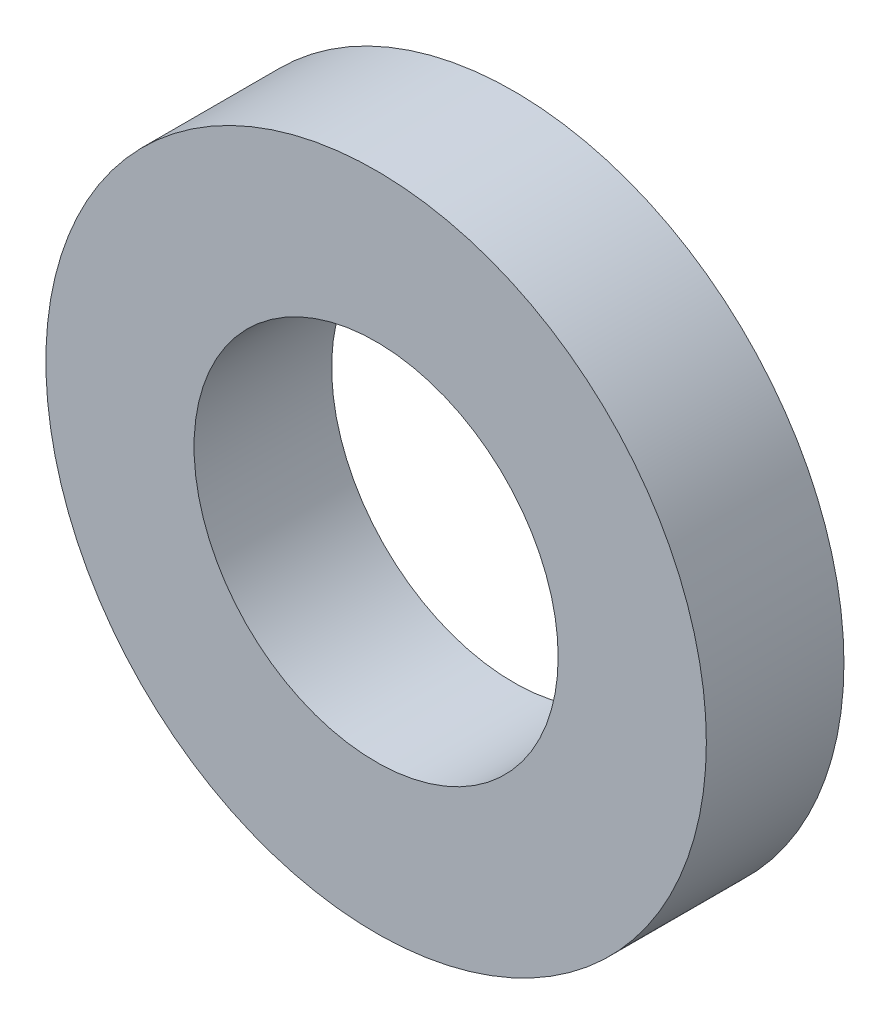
ISO-10303-21;
HEADER;
FILE_DESCRIPTION(('STEP AP214'),'2;1');
FILE_NAME('part.step','',(''),(''),'','','');
FILE_SCHEMA(('AUTOMOTIVE_DESIGN { 1 0 10303 214 1 1 1 1 }'));
ENDSEC;
DATA;
#1=APPLICATION_CONTEXT('core data for automotive mechanical design processes');
#2=APPLICATION_PROTOCOL_DEFINITION('international standard','automotive_design',2000,#1);
#3=PRODUCT_CONTEXT('',#1,'mechanical');
#4=PRODUCT('Part','Part','',(#3));
#5=PRODUCT_RELATED_PRODUCT_CATEGORY('part','',(#4));
#6=PRODUCT_DEFINITION_FORMATION('','',#4);
#7=PRODUCT_DEFINITION_CONTEXT('part definition',#1,'design');
#8=PRODUCT_DEFINITION('design','',#6,#7);
#9=PRODUCT_DEFINITION_SHAPE('','',#8);
#10=(LENGTH_UNIT() NAMED_UNIT(*) SI_UNIT(.MILLI.,.METRE.));
#11=(NAMED_UNIT(*) PLANE_ANGLE_UNIT() SI_UNIT($,.RADIAN.));
#12=(NAMED_UNIT(*) SI_UNIT($,.STERADIAN.) SOLID_ANGLE_UNIT());
#13=UNCERTAINTY_MEASURE_WITH_UNIT(LENGTH_MEASURE(1.E-05),#10,'distance_accuracy_value','');
#14=(GEOMETRIC_REPRESENTATION_CONTEXT(3) GLOBAL_UNCERTAINTY_ASSIGNED_CONTEXT((#13)) GLOBAL_UNIT_ASSIGNED_CONTEXT((#10,
#11,#12)) REPRESENTATION_CONTEXT('',''));
#15=CARTESIAN_POINT('',(0.,0.,0.));
#16=DIRECTION('',(0.,0.,1.));
#17=DIRECTION('',(1.,0.,0.));
#18=AXIS2_PLACEMENT_3D('',#15,#16,#17);
#19=CARTESIAN_POINT('',(0.,0.,-1.651));
#20=DIRECTION('',(0.,0.,1.));
#21=DIRECTION('',(1.,0.,0.));
#22=AXIS2_PLACEMENT_3D('',#19,#20,#21);
#23=CYLINDRICAL_SURFACE('',#22,3.9624);
#24=CARTESIAN_POINT('',(0.,0.,-1.651));
#25=DIRECTION('',(0.,0.,1.));
#26=DIRECTION('',(1.,0.,0.));
#27=AXIS2_PLACEMENT_3D('',#24,#25,#26);
#28=CIRCLE('',#27,3.9624);
#29=CARTESIAN_POINT('',(3.9624,0.,-1.651));
#30=VERTEX_POINT('',#29);
#31=EDGE_CURVE('E10',#30,#30,#28,.T.);
#32=CARTESIAN_POINT('',(0.,0.,0.));
#33=DIRECTION('',(0.,0.,1.));
#34=DIRECTION('',(1.,0.,0.));
#35=AXIS2_PLACEMENT_3D('',#32,#33,#34);
#36=CIRCLE('',#35,3.9624);
#37=CARTESIAN_POINT('',(3.9624,0.,0.));
#38=VERTEX_POINT('',#37);
#39=EDGE_CURVE('E39',#38,#38,#36,.T.);
#40=CARTESIAN_POINT('',(3.9624,0.,-1.651));
#41=CARTESIAN_POINT('',(3.9624,0.,-1.63380208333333));
#42=CARTESIAN_POINT('',(3.9624,0.,-1.61660416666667));
#43=CARTESIAN_POINT('',(3.9624,0.,-1.58220833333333));
#44=CARTESIAN_POINT('',(3.9624,0.,-1.56501041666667));
#45=CARTESIAN_POINT('',(3.9624,0.,-1.53061458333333));
#46=CARTESIAN_POINT('',(3.9624,0.,-1.51341666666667));
#47=CARTESIAN_POINT('',(3.9624,0.,-1.47902083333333));
#48=CARTESIAN_POINT('',(3.9624,0.,-1.46182291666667));
#49=CARTESIAN_POINT('',(3.9624,0.,-1.42742708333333));
#50=CARTESIAN_POINT('',(3.9624,0.,-1.41022916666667));
#51=CARTESIAN_POINT('',(3.9624,0.,-1.37583333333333));
#52=CARTESIAN_POINT('',(3.9624,0.,-1.35863541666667));
#53=CARTESIAN_POINT('',(3.9624,0.,-1.32423958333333));
#54=CARTESIAN_POINT('',(3.9624,0.,-1.30704166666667));
#55=CARTESIAN_POINT('',(3.9624,0.,-1.27264583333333));
#56=CARTESIAN_POINT('',(3.9624,0.,-1.25544791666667));
#57=CARTESIAN_POINT('',(3.9624,0.,-1.22105208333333));
#58=CARTESIAN_POINT('',(3.9624,0.,-1.20385416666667));
#59=CARTESIAN_POINT('',(3.9624,0.,-1.16945833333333));
#60=CARTESIAN_POINT('',(3.9624,0.,-1.15226041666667));
#61=CARTESIAN_POINT('',(3.9624,0.,-1.11786458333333));
#62=CARTESIAN_POINT('',(3.9624,0.,-1.10066666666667));
#63=CARTESIAN_POINT('',(3.9624,0.,-1.06627083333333));
#64=CARTESIAN_POINT('',(3.9624,0.,-1.04907291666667));
#65=CARTESIAN_POINT('',(3.9624,0.,-1.01467708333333));
#66=CARTESIAN_POINT('',(3.9624,0.,-0.997479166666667));
#67=CARTESIAN_POINT('',(3.9624,0.,-0.963083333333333));
#68=CARTESIAN_POINT('',(3.9624,0.,-0.945885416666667));
#69=CARTESIAN_POINT('',(3.9624,0.,-0.911489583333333));
#70=CARTESIAN_POINT('',(3.9624,0.,-0.894291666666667));
#71=CARTESIAN_POINT('',(3.9624,0.,-0.859895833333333));
#72=CARTESIAN_POINT('',(3.9624,0.,-0.842697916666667));
#73=CARTESIAN_POINT('',(3.9624,0.,-0.808302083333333));
#74=CARTESIAN_POINT('',(3.9624,0.,-0.791104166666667));
#75=CARTESIAN_POINT('',(3.9624,0.,-0.756708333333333));
#76=CARTESIAN_POINT('',(3.9624,0.,-0.739510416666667));
#77=CARTESIAN_POINT('',(3.9624,0.,-0.705114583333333));
#78=CARTESIAN_POINT('',(3.9624,0.,-0.687916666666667));
#79=CARTESIAN_POINT('',(3.9624,0.,-0.653520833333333));
#80=CARTESIAN_POINT('',(3.9624,0.,-0.636322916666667));
#81=CARTESIAN_POINT('',(3.9624,0.,-0.601927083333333));
#82=CARTESIAN_POINT('',(3.9624,0.,-0.584729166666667));
#83=CARTESIAN_POINT('',(3.9624,0.,-0.550333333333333));
#84=CARTESIAN_POINT('',(3.9624,0.,-0.533135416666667));
#85=CARTESIAN_POINT('',(3.9624,0.,-0.498739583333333));
#86=CARTESIAN_POINT('',(3.9624,0.,-0.481541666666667));
#87=CARTESIAN_POINT('',(3.9624,0.,-0.447145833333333));
#88=CARTESIAN_POINT('',(3.9624,0.,-0.429947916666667));
#89=CARTESIAN_POINT('',(3.9624,0.,-0.395552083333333));
#90=CARTESIAN_POINT('',(3.9624,0.,-0.378354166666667));
#91=CARTESIAN_POINT('',(3.9624,0.,-0.343958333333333));
#92=CARTESIAN_POINT('',(3.9624,0.,-0.326760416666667));
#93=CARTESIAN_POINT('',(3.9624,0.,-0.292364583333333));
#94=CARTESIAN_POINT('',(3.9624,0.,-0.275166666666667));
#95=CARTESIAN_POINT('',(3.9624,0.,-0.240770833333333));
#96=CARTESIAN_POINT('',(3.9624,0.,-0.223572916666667));
#97=CARTESIAN_POINT('',(3.9624,0.,-0.189177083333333));
#98=CARTESIAN_POINT('',(3.9624,0.,-0.171979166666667));
#99=CARTESIAN_POINT('',(3.9624,0.,-0.137583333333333));
#100=CARTESIAN_POINT('',(3.9624,0.,-0.120385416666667));
#101=CARTESIAN_POINT('',(3.9624,0.,-0.0859895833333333));
#102=CARTESIAN_POINT('',(3.9624,0.,-0.0687916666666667));
#103=CARTESIAN_POINT('',(3.9624,0.,-0.0343958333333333));
#104=CARTESIAN_POINT('',(3.9624,0.,-0.0171979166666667));
#105=CARTESIAN_POINT('',(3.9624,0.,0.));
#106=B_SPLINE_CURVE_WITH_KNOTS('',3,(#40,#41,#42,#43,#44,#45,#46,#47,#48,#49,#50,#51,#52,#53,
#54,#55,#56,#57,#58,#59,#60,#61,#62,#63,#64,#65,#66,#67,#68,#69,#70,#71,#72,#73,#74,#75,#76,#77,
#78,#79,#80,#81,#82,#83,#84,#85,#86,#87,#88,#89,#90,#91,#92,#93,#94,#95,#96,#97,#98,#99,#100,
#101,#102,#103,#104,#105),.UNSPECIFIED.,.F.,.F.,(4,2,2,2,2,2,2,2,2,2,2,2,2,2,2,2,2,2,2,2,2,2,2,
2,2,2,2,2,2,2,2,2,4),(0.,0.0515937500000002,0.1031875,0.15478125,0.206375,0.25796875,0.3095625,
0.36115625,0.41275,0.46434375,0.5159375,0.56753125,0.619125,0.67071875,0.7223125,0.77390625,
0.8255,0.87709375,0.9286875,0.98028125,1.031875,1.08346875,1.1350625,1.18665625,1.23825,
1.28984375,1.3414375,1.39303125,1.444625,1.49621875,1.5478125,1.59940625,1.651),.UNSPECIFIED.);
#107=EDGE_CURVE('BSEAM36',#30,#38,#106,.T.);
#108=ORIENTED_EDGE('',*,*,#31,.T.);
#109=ORIENTED_EDGE('',*,*,#39,.F.);
#110=ORIENTED_EDGE('',*,*,#107,.T.);
#111=ORIENTED_EDGE('',*,*,#107,.F.);
#112=EDGE_LOOP('',(#108,#110,#109,#111));
#113=FACE_BOUND('',#112,.T.);
#114=ADVANCED_FACE('F36',(#113),#23,.T.);
#115=CARTESIAN_POINT('',(0.,0.,-1.651));
#116=DIRECTION('',(0.,0.,1.));
#117=DIRECTION('',(1.,0.,0.));
#118=AXIS2_PLACEMENT_3D('',#115,#116,#117);
#119=PLANE('',#118);
#120=CARTESIAN_POINT('',(0.,0.,-1.651));
#121=DIRECTION('',(0.,0.,1.));
#122=DIRECTION('',(1.,0.,0.));
#123=AXIS2_PLACEMENT_3D('',#120,#121,#122);
#124=CIRCLE('',#123,2.1844);
#125=CARTESIAN_POINT('',(2.1844,0.,-1.651));
#126=VERTEX_POINT('',#125);
#127=EDGE_CURVE('E48',#126,#126,#124,.T.);
#128=ORIENTED_EDGE('',*,*,#127,.T.);
#129=EDGE_LOOP('',(#128));
#130=FACE_BOUND('',#129,.T.);
#131=ORIENTED_EDGE('',*,*,#31,.F.);
#132=EDGE_LOOP('',(#131));
#133=FACE_BOUND('',#132,.T.);
#134=ADVANCED_FACE('F58',(#130,#133),#119,.F.);
#135=CARTESIAN_POINT('',(0.,0.,0.));
#136=DIRECTION('',(0.,0.,1.));
#137=DIRECTION('',(1.,0.,0.));
#138=AXIS2_PLACEMENT_3D('',#135,#136,#137);
#139=PLANE('',#138);
#140=CARTESIAN_POINT('',(0.,0.,0.));
#141=DIRECTION('',(0.,0.,1.));
#142=DIRECTION('',(1.,0.,0.));
#143=AXIS2_PLACEMENT_3D('',#140,#141,#142);
#144=CIRCLE('',#143,2.1844);
#145=CARTESIAN_POINT('',(2.1844,0.,0.));
#146=VERTEX_POINT('',#145);
#147=EDGE_CURVE('E50',#146,#146,#144,.T.);
#148=ORIENTED_EDGE('',*,*,#147,.F.);
#149=EDGE_LOOP('',(#148));
#150=FACE_BOUND('',#149,.T.);
#151=ORIENTED_EDGE('',*,*,#39,.T.);
#152=EDGE_LOOP('',(#151));
#153=FACE_BOUND('',#152,.T.);
#154=ADVANCED_FACE('F64',(#150,#153),#139,.T.);
#155=CARTESIAN_POINT('',(0.,0.,-1.651));
#156=DIRECTION('',(0.,0.,1.));
#157=DIRECTION('',(1.,0.,0.));
#158=AXIS2_PLACEMENT_3D('',#155,#156,#157);
#159=CYLINDRICAL_SURFACE('',#158,2.1844);
#160=CARTESIAN_POINT('',(2.1844,0.,-1.651));
#161=CARTESIAN_POINT('',(2.1844,0.,-1.63380208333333));
#162=CARTESIAN_POINT('',(2.1844,0.,-1.61660416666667));
#163=CARTESIAN_POINT('',(2.1844,0.,-1.58220833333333));
#164=CARTESIAN_POINT('',(2.1844,0.,-1.56501041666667));
#165=CARTESIAN_POINT('',(2.1844,0.,-1.53061458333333));
#166=CARTESIAN_POINT('',(2.1844,0.,-1.51341666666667));
#167=CARTESIAN_POINT('',(2.1844,0.,-1.47902083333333));
#168=CARTESIAN_POINT('',(2.1844,0.,-1.46182291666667));
#169=CARTESIAN_POINT('',(2.1844,0.,-1.42742708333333));
#170=CARTESIAN_POINT('',(2.1844,0.,-1.41022916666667));
#171=CARTESIAN_POINT('',(2.1844,0.,-1.37583333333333));
#172=CARTESIAN_POINT('',(2.1844,0.,-1.35863541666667));
#173=CARTESIAN_POINT('',(2.1844,0.,-1.32423958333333));
#174=CARTESIAN_POINT('',(2.1844,0.,-1.30704166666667));
#175=CARTESIAN_POINT('',(2.1844,0.,-1.27264583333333));
#176=CARTESIAN_POINT('',(2.1844,0.,-1.25544791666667));
#177=CARTESIAN_POINT('',(2.1844,0.,-1.22105208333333));
#178=CARTESIAN_POINT('',(2.1844,0.,-1.20385416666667));
#179=CARTESIAN_POINT('',(2.1844,0.,-1.16945833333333));
#180=CARTESIAN_POINT('',(2.1844,0.,-1.15226041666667));
#181=CARTESIAN_POINT('',(2.1844,0.,-1.11786458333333));
#182=CARTESIAN_POINT('',(2.1844,0.,-1.10066666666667));
#183=CARTESIAN_POINT('',(2.1844,0.,-1.06627083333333));
#184=CARTESIAN_POINT('',(2.1844,0.,-1.04907291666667));
#185=CARTESIAN_POINT('',(2.1844,0.,-1.01467708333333));
#186=CARTESIAN_POINT('',(2.1844,0.,-0.997479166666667));
#187=CARTESIAN_POINT('',(2.1844,0.,-0.963083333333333));
#188=CARTESIAN_POINT('',(2.1844,0.,-0.945885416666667));
#189=CARTESIAN_POINT('',(2.1844,0.,-0.911489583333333));
#190=CARTESIAN_POINT('',(2.1844,0.,-0.894291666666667));
#191=CARTESIAN_POINT('',(2.1844,0.,-0.859895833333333));
#192=CARTESIAN_POINT('',(2.1844,0.,-0.842697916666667));
#193=CARTESIAN_POINT('',(2.1844,0.,-0.808302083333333));
#194=CARTESIAN_POINT('',(2.1844,0.,-0.791104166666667));
#195=CARTESIAN_POINT('',(2.1844,0.,-0.756708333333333));
#196=CARTESIAN_POINT('',(2.1844,0.,-0.739510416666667));
#197=CARTESIAN_POINT('',(2.1844,0.,-0.705114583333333));
#198=CARTESIAN_POINT('',(2.1844,0.,-0.687916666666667));
#199=CARTESIAN_POINT('',(2.1844,0.,-0.653520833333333));
#200=CARTESIAN_POINT('',(2.1844,0.,-0.636322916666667));
#201=CARTESIAN_POINT('',(2.1844,0.,-0.601927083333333));
#202=CARTESIAN_POINT('',(2.1844,0.,-0.584729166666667));
#203=CARTESIAN_POINT('',(2.1844,0.,-0.550333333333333));
#204=CARTESIAN_POINT('',(2.1844,0.,-0.533135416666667));
#205=CARTESIAN_POINT('',(2.1844,0.,-0.498739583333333));
#206=CARTESIAN_POINT('',(2.1844,0.,-0.481541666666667));
#207=CARTESIAN_POINT('',(2.1844,0.,-0.447145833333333));
#208=CARTESIAN_POINT('',(2.1844,0.,-0.429947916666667));
#209=CARTESIAN_POINT('',(2.1844,0.,-0.395552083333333));
#210=CARTESIAN_POINT('',(2.1844,0.,-0.378354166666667));
#211=CARTESIAN_POINT('',(2.1844,0.,-0.343958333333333));
#212=CARTESIAN_POINT('',(2.1844,0.,-0.326760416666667));
#213=CARTESIAN_POINT('',(2.1844,0.,-0.292364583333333));
#214=CARTESIAN_POINT('',(2.1844,0.,-0.275166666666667));
#215=CARTESIAN_POINT('',(2.1844,0.,-0.240770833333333));
#216=CARTESIAN_POINT('',(2.1844,0.,-0.223572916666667));
#217=CARTESIAN_POINT('',(2.1844,0.,-0.189177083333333));
#218=CARTESIAN_POINT('',(2.1844,0.,-0.171979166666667));
#219=CARTESIAN_POINT('',(2.1844,0.,-0.137583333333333));
#220=CARTESIAN_POINT('',(2.1844,0.,-0.120385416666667));
#221=CARTESIAN_POINT('',(2.1844,0.,-0.0859895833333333));
#222=CARTESIAN_POINT('',(2.1844,0.,-0.0687916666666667));
#223=CARTESIAN_POINT('',(2.1844,0.,-0.0343958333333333));
#224=CARTESIAN_POINT('',(2.1844,0.,-0.0171979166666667));
#225=CARTESIAN_POINT('',(2.1844,0.,0.));
#226=B_SPLINE_CURVE_WITH_KNOTS('',3,(#160,#161,#162,#163,#164,#165,#166,#167,#168,#169,#170,
#171,#172,#173,#174,#175,#176,#177,#178,#179,#180,#181,#182,#183,#184,#185,#186,#187,#188,#189,
#190,#191,#192,#193,#194,#195,#196,#197,#198,#199,#200,#201,#202,#203,#204,#205,#206,#207,#208,
#209,#210,#211,#212,#213,#214,#215,#216,#217,#218,#219,#220,#221,#222,#223,#224,#225),
.UNSPECIFIED.,.F.,.F.,(4,2,2,2,2,2,2,2,2,2,2,2,2,2,2,2,2,2,2,2,2,2,2,2,2,2,2,2,2,2,2,2,4),(0.,
0.0515937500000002,0.1031875,0.15478125,0.206375,0.25796875,0.3095625,0.36115625,0.41275,
0.46434375,0.5159375,0.56753125,0.619125,0.67071875,0.7223125,0.77390625,0.8255,0.87709375,
0.9286875,0.98028125,1.031875,1.08346875,1.1350625,1.18665625,1.23825,1.28984375,1.3414375,
1.39303125,1.444625,1.49621875,1.5478125,1.59940625,1.651),.UNSPECIFIED.);
#227=EDGE_CURVE('BSEAM61',#126,#146,#226,.T.);
#228=ORIENTED_EDGE('',*,*,#127,.F.);
#229=ORIENTED_EDGE('',*,*,#147,.T.);
#230=ORIENTED_EDGE('',*,*,#227,.T.);
#231=ORIENTED_EDGE('',*,*,#227,.F.);
#232=EDGE_LOOP('',(#228,#230,#229,#231));
#233=FACE_BOUND('',#232,.T.);
#234=ADVANCED_FACE('F61',(#233),#159,.F.);
#235=CLOSED_SHELL('',(#114,#134,#154,#234));
#236=MANIFOLD_SOLID_BREP('B2',#235);
#237=ADVANCED_BREP_SHAPE_REPRESENTATION('',(#18,#236),#14);
#238=SHAPE_DEFINITION_REPRESENTATION(#9,#237);
ENDSEC;
END-ISO-10303-21;
